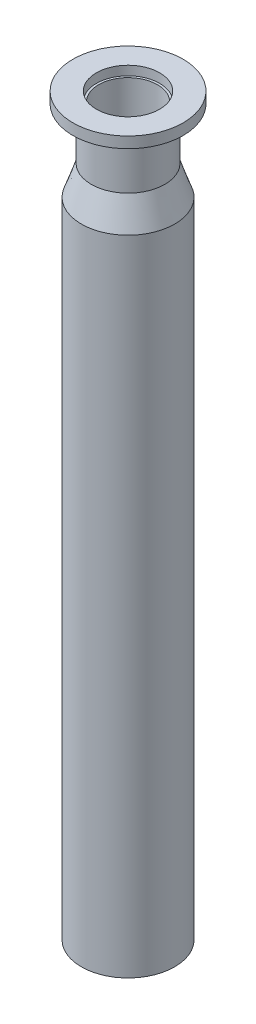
ISO-10303-21;
HEADER;
FILE_DESCRIPTION(('STEP AP214'),'2;1');
FILE_NAME('part.step','',(''),(''),'','','');
FILE_SCHEMA(('AUTOMOTIVE_DESIGN { 1 0 10303 214 1 1 1 1 }'));
ENDSEC;
DATA;
#1=APPLICATION_CONTEXT('core data for automotive mechanical design processes');
#2=APPLICATION_PROTOCOL_DEFINITION('international standard','automotive_design',2000,#1);
#3=PRODUCT_CONTEXT('',#1,'mechanical');
#4=PRODUCT('Part','Part','',(#3));
#5=PRODUCT_RELATED_PRODUCT_CATEGORY('part','',(#4));
#6=PRODUCT_DEFINITION_FORMATION('','',#4);
#7=PRODUCT_DEFINITION_CONTEXT('part definition',#1,'design');
#8=PRODUCT_DEFINITION('design','',#6,#7);
#9=PRODUCT_DEFINITION_SHAPE('','',#8);
#10=(LENGTH_UNIT() NAMED_UNIT(*) SI_UNIT(.MILLI.,.METRE.));
#11=(NAMED_UNIT(*) PLANE_ANGLE_UNIT() SI_UNIT($,.RADIAN.));
#12=(NAMED_UNIT(*) SI_UNIT($,.STERADIAN.) SOLID_ANGLE_UNIT());
#13=UNCERTAINTY_MEASURE_WITH_UNIT(LENGTH_MEASURE(1.E-05),#10,'distance_accuracy_value','');
#14=(GEOMETRIC_REPRESENTATION_CONTEXT(3) GLOBAL_UNCERTAINTY_ASSIGNED_CONTEXT((#13)) GLOBAL_UNIT_ASSIGNED_CONTEXT((#10,
#11,#12)) REPRESENTATION_CONTEXT('',''));
#15=CARTESIAN_POINT('',(0.,0.,0.));
#16=DIRECTION('',(0.,0.,1.));
#17=DIRECTION('',(1.,0.,0.));
#18=AXIS2_PLACEMENT_3D('',#15,#16,#17);
#19=CARTESIAN_POINT('',(0.,-78.,0.));
#20=DIRECTION('',(0.,1.,0.));
#21=DIRECTION('',(0.,0.,-1.));
#22=AXIS2_PLACEMENT_3D('',#19,#20,#21);
#23=PLANE('',#22);
#24=CARTESIAN_POINT('',(0.,-78.,0.));
#25=DIRECTION('',(0.,1.,0.));
#26=DIRECTION('',(1.,0.,0.));
#27=AXIS2_PLACEMENT_3D('',#24,#25,#26);
#28=CIRCLE('',#27,8.6);
#29=CARTESIAN_POINT('',(8.6,-78.,0.));
#30=VERTEX_POINT('',#29);
#31=EDGE_CURVE('E96',#30,#30,#28,.T.);
#32=ORIENTED_EDGE('',*,*,#31,.F.);
#33=EDGE_LOOP('',(#32));
#34=FACE_BOUND('',#33,.T.);
#35=CARTESIAN_POINT('',(0.,-78.,0.));
#36=DIRECTION('',(0.,1.,0.));
#37=DIRECTION('',(1.,0.,0.));
#38=AXIS2_PLACEMENT_3D('',#35,#36,#37);
#39=CIRCLE('',#38,15.);
#40=CARTESIAN_POINT('',(15.,-78.,0.));
#41=VERTEX_POINT('',#40);
#42=EDGE_CURVE('E10',#41,#41,#39,.T.);
#43=ORIENTED_EDGE('',*,*,#42,.T.);
#44=EDGE_LOOP('',(#43));
#45=FACE_BOUND('',#44,.T.);
#46=ADVANCED_FACE('F16',(#34,#45),#23,.T.);
#47=CARTESIAN_POINT('',(0.,-81.,0.));
#48=DIRECTION('',(0.,1.,0.));
#49=DIRECTION('',(1.,0.,0.));
#50=AXIS2_PLACEMENT_3D('',#47,#48,#49);
#51=CYLINDRICAL_SURFACE('',#50,15.);
#52=CARTESIAN_POINT('',(0.,-81.,0.));
#53=DIRECTION('',(0.,1.,0.));
#54=DIRECTION('',(1.,0.,0.));
#55=AXIS2_PLACEMENT_3D('',#52,#53,#54);
#56=CIRCLE('',#55,15.);
#57=CARTESIAN_POINT('',(15.,-81.,0.));
#58=VERTEX_POINT('',#57);
#59=EDGE_CURVE('E111',#58,#58,#56,.T.);
#60=ORIENTED_EDGE('',*,*,#59,.T.);
#61=DIRECTION('',(0.,1.,0.));
#62=VECTOR('',#61,1.);
#63=CARTESIAN_POINT('',(15.,-81.,0.));
#64=LINE('',#63,#62);
#65=EDGE_CURVE('E27',#58,#41,#64,.T.);
#66=ORIENTED_EDGE('',*,*,#65,.T.);
#67=ORIENTED_EDGE('',*,*,#42,.F.);
#68=ORIENTED_EDGE('',*,*,#65,.F.);
#69=EDGE_LOOP('',(#60,#66,#67,#68));
#70=FACE_BOUND('',#69,.T.);
#71=ADVANCED_FACE('F18',(#70),#51,.T.);
#72=CARTESIAN_POINT('',(0.,-82.339745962,0.));
#73=DIRECTION('',(0.,1.,0.));
#74=DIRECTION('',(1.,0.,0.));
#75=AXIS2_PLACEMENT_3D('',#72,#73,#74);
#76=CONICAL_SURFACE('',#75,10.,1.308996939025);
#77=CARTESIAN_POINT('',(0.,-82.339745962,0.));
#78=DIRECTION('',(0.,1.,0.));
#79=DIRECTION('',(1.,0.,0.));
#80=AXIS2_PLACEMENT_3D('',#77,#78,#79);
#81=CIRCLE('',#80,10.);
#82=CARTESIAN_POINT('',(10.,-82.339745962,0.));
#83=VERTEX_POINT('',#82);
#84=EDGE_CURVE('E119',#83,#83,#81,.T.);
#85=ORIENTED_EDGE('',*,*,#84,.T.);
#86=DIRECTION('',(0.96592582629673,0.258819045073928,0.));
#87=VECTOR('',#86,1.);
#88=CARTESIAN_POINT('',(10.,-82.339745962,0.));
#89=LINE('',#88,#87);
#90=EDGE_CURVE('E115',#83,#58,#89,.T.);
#91=ORIENTED_EDGE('',*,*,#90,.T.);
#92=ORIENTED_EDGE('',*,*,#59,.F.);
#93=ORIENTED_EDGE('',*,*,#90,.F.);
#94=EDGE_LOOP('',(#85,#91,#92,#93));
#95=FACE_BOUND('',#94,.T.);
#96=ADVANCED_FACE('F198',(#95),#76,.T.);
#97=CARTESIAN_POINT('',(0.,-95.,0.));
#98=DIRECTION('',(0.,1.,0.));
#99=DIRECTION('',(1.,0.,0.));
#100=AXIS2_PLACEMENT_3D('',#97,#98,#99);
#101=CYLINDRICAL_SURFACE('',#100,10.);
#102=CARTESIAN_POINT('',(0.,-95.,0.));
#103=DIRECTION('',(0.,1.,0.));
#104=DIRECTION('',(1.,0.,0.));
#105=AXIS2_PLACEMENT_3D('',#102,#103,#104);
#106=CIRCLE('',#105,10.);
#107=CARTESIAN_POINT('',(10.,-95.,0.));
#108=VERTEX_POINT('',#107);
#109=EDGE_CURVE('E131',#108,#108,#106,.T.);
#110=ORIENTED_EDGE('',*,*,#109,.T.);
#111=DIRECTION('',(0.,1.,0.));
#112=VECTOR('',#111,1.);
#113=CARTESIAN_POINT('',(10.,-95.,0.));
#114=LINE('',#113,#112);
#115=EDGE_CURVE('E123',#108,#83,#114,.T.);
#116=ORIENTED_EDGE('',*,*,#115,.T.);
#117=ORIENTED_EDGE('',*,*,#84,.F.);
#118=ORIENTED_EDGE('',*,*,#115,.F.);
#119=EDGE_LOOP('',(#110,#116,#117,#118));
#120=FACE_BOUND('',#119,.T.);
#121=ADVANCED_FACE('F208',(#120),#101,.T.);
#122=CARTESIAN_POINT('',(0.,-103.,0.));
#123=DIRECTION('',(0.,-1.,0.));
#124=DIRECTION('',(1.,0.,0.));
#125=AXIS2_PLACEMENT_3D('',#122,#123,#124);
#126=CONICAL_SURFACE('',#125,12.7,0.325495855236);
#127=CARTESIAN_POINT('',(0.,-103.,0.));
#128=DIRECTION('',(0.,1.,0.));
#129=DIRECTION('',(1.,0.,0.));
#130=AXIS2_PLACEMENT_3D('',#127,#128,#129);
#131=CIRCLE('',#130,12.7);
#132=CARTESIAN_POINT('',(12.7,-103.,0.));
#133=VERTEX_POINT('',#132);
#134=EDGE_CURVE('E109',#133,#133,#131,.T.);
#135=ORIENTED_EDGE('',*,*,#134,.T.);
#136=DIRECTION('',(-0.319778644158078,0.947492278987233,0.));
#137=VECTOR('',#136,1.);
#138=CARTESIAN_POINT('',(12.7,-103.,0.));
#139=LINE('',#138,#137);
#140=EDGE_CURVE('E68',#133,#108,#139,.T.);
#141=ORIENTED_EDGE('',*,*,#140,.T.);
#142=ORIENTED_EDGE('',*,*,#109,.F.);
#143=ORIENTED_EDGE('',*,*,#140,.F.);
#144=EDGE_LOOP('',(#135,#141,#142,#143));
#145=FACE_BOUND('',#144,.T.);
#146=ADVANCED_FACE('F177',(#145),#126,.T.);
#147=CARTESIAN_POINT('',(0.,-278.,0.));
#148=DIRECTION('',(0.,1.,0.));
#149=DIRECTION('',(1.,0.,0.));
#150=AXIS2_PLACEMENT_3D('',#147,#148,#149);
#151=CYLINDRICAL_SURFACE('',#150,12.7);
#152=CARTESIAN_POINT('',(0.,-278.,0.));
#153=DIRECTION('',(0.,1.,0.));
#154=DIRECTION('',(1.,0.,0.));
#155=AXIS2_PLACEMENT_3D('',#152,#153,#154);
#156=CIRCLE('',#155,12.7);
#157=CARTESIAN_POINT('',(12.7,-278.,0.));
#158=VERTEX_POINT('',#157);
#159=EDGE_CURVE('E138',#158,#158,#156,.T.);
#160=ORIENTED_EDGE('',*,*,#159,.T.);
#161=DIRECTION('',(0.,1.,0.));
#162=VECTOR('',#161,1.);
#163=CARTESIAN_POINT('',(12.7,-278.,0.));
#164=LINE('',#163,#162);
#165=EDGE_CURVE('E78',#158,#133,#164,.T.);
#166=ORIENTED_EDGE('',*,*,#165,.T.);
#167=ORIENTED_EDGE('',*,*,#134,.F.);
#168=ORIENTED_EDGE('',*,*,#165,.F.);
#169=EDGE_LOOP('',(#160,#166,#167,#168));
#170=FACE_BOUND('',#169,.T.);
#171=ADVANCED_FACE('F178',(#170),#151,.T.);
#172=CARTESIAN_POINT('',(0.,-278.,0.));
#173=DIRECTION('',(0.,1.,0.));
#174=DIRECTION('',(0.,0.,-1.));
#175=AXIS2_PLACEMENT_3D('',#172,#173,#174);
#176=PLANE('',#175);
#177=ORIENTED_EDGE('',*,*,#159,.F.);
#178=EDGE_LOOP('',(#177));
#179=FACE_BOUND('',#178,.T.);
#180=CARTESIAN_POINT('',(0.,-278.,0.));
#181=DIRECTION('',(0.,1.,0.));
#182=DIRECTION('',(1.,0.,0.));
#183=AXIS2_PLACEMENT_3D('',#180,#181,#182);
#184=CIRCLE('',#183,11.2);
#185=CARTESIAN_POINT('',(11.2,-278.,0.));
#186=VERTEX_POINT('',#185);
#187=EDGE_CURVE('E137',#186,#186,#184,.T.);
#188=ORIENTED_EDGE('',*,*,#187,.T.);
#189=EDGE_LOOP('',(#188));
#190=FACE_BOUND('',#189,.T.);
#191=ADVANCED_FACE('F148',(#179,#190),#176,.F.);
#192=CARTESIAN_POINT('',(0.,-103.,0.));
#193=DIRECTION('',(0.,-1.,0.));
#194=DIRECTION('',(1.,0.,0.));
#195=AXIS2_PLACEMENT_3D('',#192,#193,#194);
#196=CYLINDRICAL_SURFACE('',#195,11.2);
#197=CARTESIAN_POINT('',(0.,-103.,0.));
#198=DIRECTION('',(0.,1.,0.));
#199=DIRECTION('',(1.,0.,0.));
#200=AXIS2_PLACEMENT_3D('',#197,#198,#199);
#201=CIRCLE('',#200,11.2);
#202=CARTESIAN_POINT('',(11.2,-103.,0.));
#203=VERTEX_POINT('',#202);
#204=EDGE_CURVE('E128',#203,#203,#201,.T.);
#205=ORIENTED_EDGE('',*,*,#204,.T.);
#206=DIRECTION('',(0.,-1.,0.));
#207=VECTOR('',#206,1.);
#208=CARTESIAN_POINT('',(11.2,-103.,0.));
#209=LINE('',#208,#207);
#210=EDGE_CURVE('E133',#203,#186,#209,.T.);
#211=ORIENTED_EDGE('',*,*,#210,.T.);
#212=ORIENTED_EDGE('',*,*,#187,.F.);
#213=ORIENTED_EDGE('',*,*,#210,.F.);
#214=EDGE_LOOP('',(#205,#211,#212,#213));
#215=FACE_BOUND('',#214,.T.);
#216=ADVANCED_FACE('F150',(#215),#196,.F.);
#217=CARTESIAN_POINT('',(0.,-95.,0.));
#218=DIRECTION('',(0.,-1.,0.));
#219=DIRECTION('',(1.,0.,0.));
#220=AXIS2_PLACEMENT_3D('',#217,#218,#219);
#221=CONICAL_SURFACE('',#220,8.,0.380506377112);
#222=CARTESIAN_POINT('',(0.,-95.,0.));
#223=DIRECTION('',(0.,1.,0.));
#224=DIRECTION('',(1.,0.,0.));
#225=AXIS2_PLACEMENT_3D('',#222,#223,#224);
#226=CIRCLE('',#225,8.);
#227=CARTESIAN_POINT('',(8.,-95.,0.));
#228=VERTEX_POINT('',#227);
#229=EDGE_CURVE('E20',#228,#228,#226,.T.);
#230=ORIENTED_EDGE('',*,*,#229,.T.);
#231=DIRECTION('',(0.371390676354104,-0.928476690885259,0.));
#232=VECTOR('',#231,1.);
#233=CARTESIAN_POINT('',(8.,-95.,0.));
#234=LINE('',#233,#232);
#235=EDGE_CURVE('E124',#228,#203,#234,.T.);
#236=ORIENTED_EDGE('',*,*,#235,.T.);
#237=ORIENTED_EDGE('',*,*,#204,.F.);
#238=ORIENTED_EDGE('',*,*,#235,.F.);
#239=EDGE_LOOP('',(#230,#236,#237,#238));
#240=FACE_BOUND('',#239,.T.);
#241=ADVANCED_FACE('F154',(#240),#221,.F.);
#242=CARTESIAN_POINT('',(0.,-80.5,0.));
#243=DIRECTION('',(0.,-1.,0.));
#244=DIRECTION('',(1.,0.,0.));
#245=AXIS2_PLACEMENT_3D('',#242,#243,#244);
#246=CYLINDRICAL_SURFACE('',#245,8.);
#247=CARTESIAN_POINT('',(0.,-80.5,0.));
#248=DIRECTION('',(0.,1.,0.));
#249=DIRECTION('',(1.,0.,0.));
#250=AXIS2_PLACEMENT_3D('',#247,#248,#249);
#251=CIRCLE('',#250,8.);
#252=CARTESIAN_POINT('',(8.,-80.5,0.));
#253=VERTEX_POINT('',#252);
#254=EDGE_CURVE('E103',#253,#253,#251,.T.);
#255=ORIENTED_EDGE('',*,*,#254,.T.);
#256=DIRECTION('',(0.,-1.,0.));
#257=VECTOR('',#256,1.);
#258=CARTESIAN_POINT('',(8.,-80.5,0.));
#259=LINE('',#258,#257);
#260=EDGE_CURVE('E158',#253,#228,#259,.T.);
#261=ORIENTED_EDGE('',*,*,#260,.T.);
#262=ORIENTED_EDGE('',*,*,#229,.F.);
#263=ORIENTED_EDGE('',*,*,#260,.F.);
#264=EDGE_LOOP('',(#255,#261,#262,#263));
#265=FACE_BOUND('',#264,.T.);
#266=ADVANCED_FACE('F206',(#265),#246,.F.);
#267=CARTESIAN_POINT('',(0.,-80.5,0.));
#268=DIRECTION('',(0.,1.,0.));
#269=DIRECTION('',(0.,0.,-1.));
#270=AXIS2_PLACEMENT_3D('',#267,#268,#269);
#271=PLANE('',#270);
#272=ORIENTED_EDGE('',*,*,#254,.F.);
#273=EDGE_LOOP('',(#272));
#274=FACE_BOUND('',#273,.T.);
#275=CARTESIAN_POINT('',(0.,-80.5,0.));
#276=DIRECTION('',(0.,1.,0.));
#277=DIRECTION('',(1.,0.,0.));
#278=AXIS2_PLACEMENT_3D('',#275,#276,#277);
#279=CIRCLE('',#278,8.6);
#280=CARTESIAN_POINT('',(8.6,-80.5,0.));
#281=VERTEX_POINT('',#280);
#282=EDGE_CURVE('E97',#281,#281,#279,.T.);
#283=ORIENTED_EDGE('',*,*,#282,.T.);
#284=EDGE_LOOP('',(#283));
#285=FACE_BOUND('',#284,.T.);
#286=ADVANCED_FACE('F202',(#274,#285),#271,.T.);
#287=CARTESIAN_POINT('',(0.,-78.,0.));
#288=DIRECTION('',(0.,-1.,0.));
#289=DIRECTION('',(1.,0.,0.));
#290=AXIS2_PLACEMENT_3D('',#287,#288,#289);
#291=CYLINDRICAL_SURFACE('',#290,8.6);
#292=ORIENTED_EDGE('',*,*,#31,.T.);
#293=DIRECTION('',(0.,-1.,0.));
#294=VECTOR('',#293,1.);
#295=CARTESIAN_POINT('',(8.6,-78.,0.));
#296=LINE('',#295,#294);
#297=EDGE_CURVE('E93',#30,#281,#296,.T.);
#298=ORIENTED_EDGE('',*,*,#297,.T.);
#299=ORIENTED_EDGE('',*,*,#282,.F.);
#300=ORIENTED_EDGE('',*,*,#297,.F.);
#301=EDGE_LOOP('',(#292,#298,#299,#300));
#302=FACE_BOUND('',#301,.T.);
#303=ADVANCED_FACE('F94',(#302),#291,.F.);
#304=CLOSED_SHELL('',(#46,#71,#96,#121,#146,#171,#191,#216,#241,#266,#286,#303));
#305=MANIFOLD_SOLID_BREP('B1',#304);
#306=ADVANCED_BREP_SHAPE_REPRESENTATION('',(#18,#305),#14);
#307=SHAPE_DEFINITION_REPRESENTATION(#9,#306);
ENDSEC;
END-ISO-10303-21;
